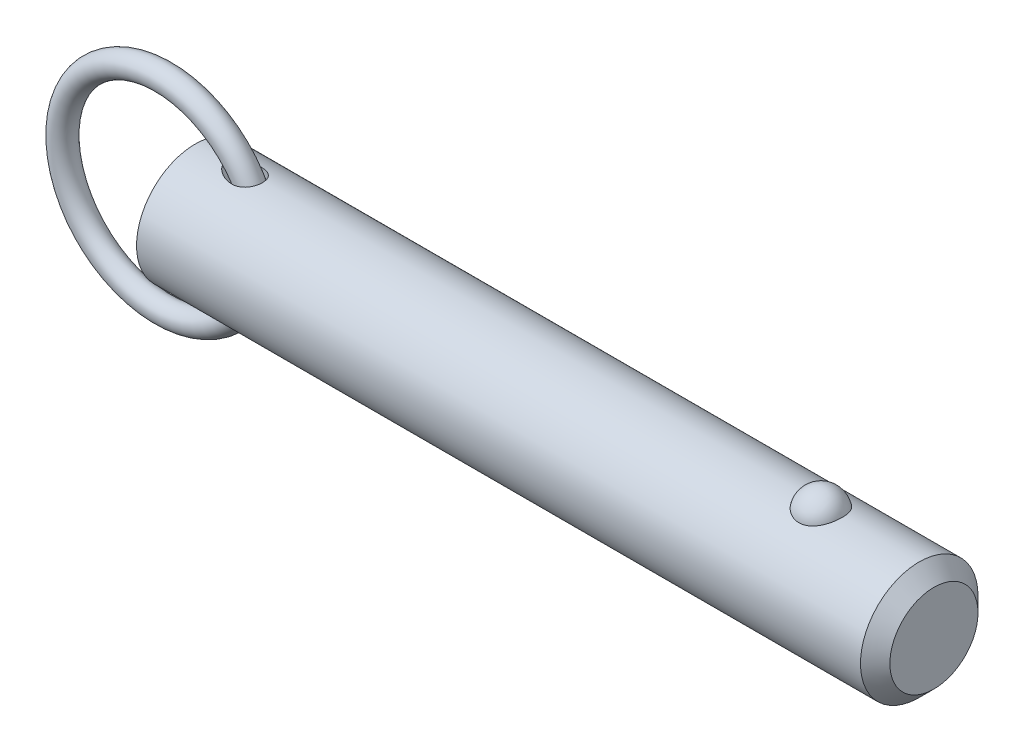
ISO-10303-21;
HEADER;
FILE_DESCRIPTION(('STEP AP214'),'2;1');
FILE_NAME('part.step','',(''),(''),'','','');
FILE_SCHEMA(('AUTOMOTIVE_DESIGN { 1 0 10303 214 1 1 1 1 }'));
ENDSEC;
DATA;
#1=APPLICATION_CONTEXT('core data for automotive mechanical design processes');
#2=APPLICATION_PROTOCOL_DEFINITION('international standard','automotive_design',2000,#1);
#3=PRODUCT_CONTEXT('',#1,'mechanical');
#4=PRODUCT('Part','Part','',(#3));
#5=PRODUCT_RELATED_PRODUCT_CATEGORY('part','',(#4));
#6=PRODUCT_DEFINITION_FORMATION('','',#4);
#7=PRODUCT_DEFINITION_CONTEXT('part definition',#1,'design');
#8=PRODUCT_DEFINITION('design','',#6,#7);
#9=PRODUCT_DEFINITION_SHAPE('','',#8);
#10=(LENGTH_UNIT() NAMED_UNIT(*) SI_UNIT(.MILLI.,.METRE.));
#11=(NAMED_UNIT(*) PLANE_ANGLE_UNIT() SI_UNIT($,.RADIAN.));
#12=(NAMED_UNIT(*) SI_UNIT($,.STERADIAN.) SOLID_ANGLE_UNIT());
#13=UNCERTAINTY_MEASURE_WITH_UNIT(LENGTH_MEASURE(1.E-05),#10,'distance_accuracy_value','');
#14=(GEOMETRIC_REPRESENTATION_CONTEXT(3) GLOBAL_UNCERTAINTY_ASSIGNED_CONTEXT((#13)) GLOBAL_UNIT_ASSIGNED_CONTEXT((#10,
#11,#12)) REPRESENTATION_CONTEXT('',''));
#15=CARTESIAN_POINT('',(0.,0.,0.));
#16=DIRECTION('',(0.,0.,1.));
#17=DIRECTION('',(1.,0.,0.));
#18=AXIS2_PLACEMENT_3D('',#15,#16,#17);
#19=CARTESIAN_POINT('',(-6.08699288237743,0.,0.));
#20=DIRECTION('',(0.,0.,1.));
#21=DIRECTION('',(1.,0.,0.));
#22=AXIS2_PLACEMENT_3D('',#19,#20,#21);
#23=TOROIDAL_SURFACE('',#22,19.05,2.223);
#24=CARTESIAN_POINT('',(15.1860071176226,0.,0.));
#25=VERTEX_POINT('',#24);
#26=VERTEX_LOOP('',#25);
#27=FACE_BOUND('',#26,.T.);
#28=ADVANCED_FACE('P0_F12',(#27),#23,.T.);
#29=CLOSED_SHELL('',(#28));
#30=MANIFOLD_SOLID_BREP('P0_B1',#29);
#31=CARTESIAN_POINT('',(0.,0.,0.));
#32=DIRECTION('',(1.,0.,0.));
#33=DIRECTION('',(0.,0.,-1.));
#34=AXIS2_PLACEMENT_3D('',#31,#32,#33);
#35=CYLINDRICAL_SURFACE('',#34,11.115);
#36=CARTESIAN_POINT('',(6.414051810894,11.0227946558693,-1.42871369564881));
#37=CARTESIAN_POINT('',(6.49338916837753,11.0115377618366,-1.5155664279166));
#38=CARTESIAN_POINT('',(6.57765461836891,10.9998263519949,-1.59789397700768));
#39=CARTESIAN_POINT('',(6.75386647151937,10.9760304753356,-1.75391400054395));
#40=CARTESIAN_POINT('',(6.84582247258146,10.9639455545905,-1.82759540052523));
#41=CARTESIAN_POINT('',(7.03627827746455,10.9397989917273,-1.96698954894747));
#42=CARTESIAN_POINT('',(7.13480838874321,10.9277377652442,-2.03266078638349));
#43=CARTESIAN_POINT('',(7.33681032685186,10.9041015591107,-2.1558582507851));
#44=CARTESIAN_POINT('',(7.44028007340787,10.8925263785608,-2.21338786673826));
#45=CARTESIAN_POINT('',(7.64386117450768,10.8710104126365,-2.31666528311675));
#46=CARTESIAN_POINT('',(7.74368989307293,10.8610119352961,-2.36295942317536));
#47=CARTESIAN_POINT('',(7.94637195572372,10.8420168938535,-2.44863486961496));
#48=CARTESIAN_POINT('',(8.04922612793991,10.8330206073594,-2.48801426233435));
#49=CARTESIAN_POINT('',(8.36115573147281,10.807980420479,-2.59542730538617));
#50=CARTESIAN_POINT('',(8.57411849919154,10.7938278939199,-2.65299817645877));
#51=CARTESIAN_POINT('',(9.00825016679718,10.7725818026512,-2.73800108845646));
#52=CARTESIAN_POINT('',(9.22947335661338,10.7655491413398,-2.76517330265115));
#53=CARTESIAN_POINT('',(9.67368141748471,10.7605872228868,-2.78445308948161));
#54=CARTESIAN_POINT('',(9.89666486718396,10.7626512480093,-2.77658653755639));
#55=CARTESIAN_POINT('',(10.2950172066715,10.7754452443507,-2.72644436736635));
#56=CARTESIAN_POINT('',(10.4712789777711,10.7844280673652,-2.69109376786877));
#57=CARTESIAN_POINT('',(10.7292776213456,10.8024982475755,-2.61722365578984));
#58=CARTESIAN_POINT('',(10.8142337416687,10.8092901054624,-2.58911576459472));
#59=CARTESIAN_POINT('',(10.9813218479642,10.8242580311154,-2.52581287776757));
#60=CARTESIAN_POINT('',(11.0634550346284,10.8324335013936,-2.49062094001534));
#61=CARTESIAN_POINT('',(11.2247418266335,10.8500287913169,-2.41281958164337));
#62=CARTESIAN_POINT('',(11.3038694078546,10.8594572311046,-2.37015806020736));
#63=CARTESIAN_POINT('',(11.4576781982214,10.8792243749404,-2.27770403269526));
#64=CARTESIAN_POINT('',(11.5323615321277,10.8895626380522,-2.22791497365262));
#65=CARTESIAN_POINT('',(11.6765388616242,10.9108113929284,-2.12140590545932));
#66=CARTESIAN_POINT('',(11.7460329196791,10.9217218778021,-2.064685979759));
#67=CARTESIAN_POINT('',(11.8790597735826,10.9437207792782,-1.94471764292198));
#68=CARTESIAN_POINT('',(11.9425932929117,10.9548091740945,-1.88147002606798));
#69=CARTESIAN_POINT('',(12.109388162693,10.9851999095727,-1.69784918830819));
#70=CARTESIAN_POINT('',(12.205655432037,11.0042655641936,-1.57093023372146));
#71=CARTESIAN_POINT('',(12.374151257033,11.0393391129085,-1.3017676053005));
#72=CARTESIAN_POINT('',(12.4463875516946,11.0553479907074,-1.15952888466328));
#73=CARTESIAN_POINT('',(12.5615818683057,11.0816338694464,-0.871972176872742));
#74=CARTESIAN_POINT('',(12.6058896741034,11.0921698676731,-0.72721773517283));
#75=CARTESIAN_POINT('',(12.6699315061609,11.1075802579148,-0.432089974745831));
#76=CARTESIAN_POINT('',(12.6896681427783,11.1124552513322,-0.281717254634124));
#77=CARTESIAN_POINT('',(12.704022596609,11.1159901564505,0.0188164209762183));
#78=CARTESIAN_POINT('',(12.6988836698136,11.1147102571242,0.16896512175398));
#79=CARTESIAN_POINT('',(12.6641681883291,11.1062126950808,0.466238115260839));
#80=CARTESIAN_POINT('',(12.6345920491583,11.0989951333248,0.613362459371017));
#81=CARTESIAN_POINT('',(12.5517453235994,11.0794095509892,0.900330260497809));
#82=CARTESIAN_POINT('',(12.4984878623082,11.0670443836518,1.04017770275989));
#83=CARTESIAN_POINT('',(12.3696588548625,11.0385082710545,1.308745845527));
#84=CARTESIAN_POINT('',(12.2940887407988,11.0223375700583,1.43746725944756));
#85=CARTESIAN_POINT('',(12.122380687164,10.987872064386,1.68079704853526));
#86=CARTESIAN_POINT('',(12.0261637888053,10.969569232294,1.79534850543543));
#87=CARTESIAN_POINT('',(11.8161707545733,10.932836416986,2.00695695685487));
#88=CARTESIAN_POINT('',(11.7023941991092,10.9144064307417,2.10401353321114));
#89=CARTESIAN_POINT('',(11.4575656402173,10.8788057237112,2.28105326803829));
#90=CARTESIAN_POINT('',(11.3261451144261,10.8616794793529,2.36053412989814));
#91=CARTESIAN_POINT('',(11.0523589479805,10.8308019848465,2.49839044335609));
#92=CARTESIAN_POINT('',(10.9099908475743,10.8170514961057,2.55676113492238));
#93=CARTESIAN_POINT('',(10.6060622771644,10.7929728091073,2.65666105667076));
#94=CARTESIAN_POINT('',(10.4438877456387,10.7830209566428,2.69640163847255));
#95=CARTESIAN_POINT('',(10.1154037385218,10.7687230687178,2.75293129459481));
#96=CARTESIAN_POINT('',(9.94909141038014,10.7643810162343,2.76970406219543));
#97=CARTESIAN_POINT('',(9.54387061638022,10.7604809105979,2.7848723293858));
#98=CARTESIAN_POINT('',(9.30446860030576,10.7637793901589,2.7722775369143));
#99=CARTESIAN_POINT('',(8.94961255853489,10.7757341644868,2.72524141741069));
#100=CARTESIAN_POINT('',(8.83186896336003,10.7808994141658,2.70482239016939));
#101=CARTESIAN_POINT('',(8.59835142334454,10.7932548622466,2.6550999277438));
#102=CARTESIAN_POINT('',(8.48257728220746,10.8004448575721,2.62579738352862));
#103=CARTESIAN_POINT('',(8.25208469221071,10.8166382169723,2.55827624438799));
#104=CARTESIAN_POINT('',(8.13740214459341,10.8256649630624,2.51994155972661));
#105=CARTESIAN_POINT('',(7.91132058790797,10.8451170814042,2.43486475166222));
#106=CARTESIAN_POINT('',(7.79992154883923,10.8555424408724,2.38812270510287));
#107=CARTESIAN_POINT('',(7.58115677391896,10.8774251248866,2.28638483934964));
#108=CARTESIAN_POINT('',(7.47378802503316,10.8888816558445,2.23139534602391));
#109=CARTESIAN_POINT('',(7.26385624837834,10.9124540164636,2.1131026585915));
#110=CARTESIAN_POINT('',(7.16129168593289,10.9245696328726,2.04980214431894));
#111=CARTESIAN_POINT('',(6.91882218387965,10.9543689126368,1.88540538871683));
#112=CARTESIAN_POINT('',(6.78193778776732,10.9721958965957,1.77979827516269));
#113=CARTESIAN_POINT('',(6.52472441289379,11.0070222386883,1.54989693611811));
#114=CARTESIAN_POINT('',(6.40436902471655,11.0240228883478,1.42563320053));
#115=CARTESIAN_POINT('',(6.21838804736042,11.0509658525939,1.19529359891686));
#116=CARTESIAN_POINT('',(6.14691885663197,11.0615430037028,1.09404520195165));
#117=CARTESIAN_POINT('',(6.02043496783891,11.0805004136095,0.881508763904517));
#118=CARTESIAN_POINT('',(5.96539400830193,11.0888841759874,0.770237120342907));
#119=CARTESIAN_POINT('',(5.88475453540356,11.1012553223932,0.560577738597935));
#120=CARTESIAN_POINT('',(5.85559643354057,11.1057686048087,0.463603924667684));
#121=CARTESIAN_POINT('',(5.81381299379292,11.1122523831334,0.266083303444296));
#122=CARTESIAN_POINT('',(5.80117118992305,11.1142254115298,0.165540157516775));
#123=CARTESIAN_POINT('',(5.79363815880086,11.1153999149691,-0.0364747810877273));
#124=CARTESIAN_POINT('',(5.79878799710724,11.1145949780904,-0.137948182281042));
#125=CARTESIAN_POINT('',(5.82639592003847,11.1102987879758,-0.338493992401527));
#126=CARTESIAN_POINT('',(5.84887234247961,11.1068046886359,-0.437563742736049));
#127=CARTESIAN_POINT('',(5.91510741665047,11.0965857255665,-0.649968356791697));
#128=CARTESIAN_POINT('',(5.96220905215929,11.0893566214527,-0.762222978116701));
#129=CARTESIAN_POINT('',(6.0737844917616,11.072471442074,-0.977396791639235));
#130=CARTESIAN_POINT('',(6.13826787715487,11.0628140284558,-1.08031079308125));
#131=CARTESIAN_POINT('',(6.24101077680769,11.0477136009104,-1.2219580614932));
#132=CARTESIAN_POINT('',(6.27403486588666,11.042895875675,-1.26469183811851));
#133=CARTESIAN_POINT('',(6.34238022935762,11.0330152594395,-1.34817011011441));
#134=CARTESIAN_POINT('',(6.37769867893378,11.0279526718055,-1.38891694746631));
#135=CARTESIAN_POINT('',(6.414051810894,11.0227946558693,-1.42871369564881));
#136=B_SPLINE_CURVE_WITH_KNOTS('',3,(#36,#37,#38,#39,#40,#41,#42,#43,#44,#45,#46,#47,#48,#49,
#50,#51,#52,#53,#54,#55,#56,#57,#58,#59,#60,#61,#62,#63,#64,#65,#66,#67,#68,#69,#70,#71,#72,#73,
#74,#75,#76,#77,#78,#79,#80,#81,#82,#83,#84,#85,#86,#87,#88,#89,#90,#91,#92,#93,#94,#95,#96,#97,
#98,#99,#100,#101,#102,#103,#104,#105,#106,#107,#108,#109,#110,#111,#112,#113,#114,#115,#116,
#117,#118,#119,#120,#121,#122,#123,#124,#125,#126,#127,#128,#129,#130,#131,#132,#133,#134,#135),
.UNSPECIFIED.,.T.,.F.,(4,2,2,2,2,2,2,2,2,2,2,2,2,2,2,2,2,2,2,2,2,2,2,2,2,2,2,2,2,2,2,2,2,2,2,2,
2,2,2,2,2,2,2,2,2,2,2,2,2,4),(0.,0.354433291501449,0.709315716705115,1.0659654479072,
1.42246628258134,1.75367157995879,2.08496839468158,2.74582009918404,3.41227815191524,
4.07824412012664,4.61583787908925,4.88478112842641,5.15360853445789,5.42439170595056,
5.6950443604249,5.96569375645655,6.23631025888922,6.7149072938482,7.1933500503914,
7.6464143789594,8.09943057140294,8.54802575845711,8.99661331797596,9.44495256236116,
9.89326303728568,10.3433195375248,10.7933867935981,11.2550086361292,11.7167345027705,
12.2165866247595,12.7167934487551,13.4318876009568,13.7904664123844,14.1490092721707,
14.5124394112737,14.8758662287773,15.239015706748,15.6020483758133,16.1219860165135,
16.6410830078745,17.0130520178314,17.3844231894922,17.6872330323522,17.9897407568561,
18.2929471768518,18.5964749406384,18.9603532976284,19.3244326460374,19.4870338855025,
19.649438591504),.UNSPECIFIED.);
#137=CARTESIAN_POINT('',(6.414051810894,11.0227946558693,-1.42871369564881));
#138=VERTEX_POINT('',#137);
#139=EDGE_CURVE('P1_E40',#138,#138,#136,.T.);
#140=ORIENTED_EDGE('',*,*,#139,.T.);
#141=EDGE_LOOP('',(#140));
#142=FACE_BOUND('',#141,.T.);
#143=CARTESIAN_POINT('',(136.92125,0.,0.));
#144=DIRECTION('',(1.,0.,0.));
#145=DIRECTION('',(0.,0.,-1.));
#146=AXIS2_PLACEMENT_3D('',#143,#144,#145);
#147=CIRCLE('',#146,11.115);
#148=CARTESIAN_POINT('',(136.92125,0.,-11.115));
#149=VERTEX_POINT('',#148);
#150=EDGE_CURVE('P1_E25',#149,#149,#147,.T.);
#151=ORIENTED_EDGE('',*,*,#150,.F.);
#152=EDGE_LOOP('',(#151));
#153=FACE_BOUND('',#152,.T.);
#154=CARTESIAN_POINT('',(0.,0.,0.));
#155=DIRECTION('',(1.,0.,0.));
#156=DIRECTION('',(0.,0.,-1.));
#157=AXIS2_PLACEMENT_3D('',#154,#155,#156);
#158=CIRCLE('',#157,11.115);
#159=CARTESIAN_POINT('',(0.,0.,-11.115));
#160=VERTEX_POINT('',#159);
#161=EDGE_CURVE('P1_E9',#160,#160,#158,.T.);
#162=ORIENTED_EDGE('',*,*,#161,.T.);
#163=EDGE_LOOP('',(#162));
#164=FACE_BOUND('',#163,.T.);
#165=CARTESIAN_POINT('',(118.331068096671,10.3028087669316,4.17077409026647));
#166=CARTESIAN_POINT('',(118.114775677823,10.3028003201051,4.17078240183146));
#167=CARTESIAN_POINT('',(117.898548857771,10.3098895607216,4.15340593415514));
#168=CARTESIAN_POINT('',(117.472540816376,10.3373834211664,4.08449540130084));
#169=CARTESIAN_POINT('',(117.262757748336,10.3577841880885,4.03297121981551));
#170=CARTESIAN_POINT('',(116.855782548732,10.4095237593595,3.89746513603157));
#171=CARTESIAN_POINT('',(116.658572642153,10.4408466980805,3.81353029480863));
#172=CARTESIAN_POINT('',(116.281338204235,10.5110236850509,3.61560339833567));
#173=CARTESIAN_POINT('',(116.101317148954,10.5498792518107,3.50160528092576));
#174=CARTESIAN_POINT('',(115.757684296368,10.6322884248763,3.24292464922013));
#175=CARTESIAN_POINT('',(115.594686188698,10.6759443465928,3.09746040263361));
#176=CARTESIAN_POINT('',(115.294591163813,10.7625291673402,2.78171925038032));
#177=CARTESIAN_POINT('',(115.157499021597,10.8054579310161,2.61143778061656));
#178=CARTESIAN_POINT('',(114.906408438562,10.8881935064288,2.24226695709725));
#179=CARTESIAN_POINT('',(114.793710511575,10.9277761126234,2.04244123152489));
#180=CARTESIAN_POINT('',(114.601777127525,10.997484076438,1.62578254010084));
#181=CARTESIAN_POINT('',(114.522544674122,11.0276085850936,1.40894804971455));
#182=CARTESIAN_POINT('',(114.398303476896,11.0756732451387,0.961250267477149));
#183=CARTESIAN_POINT('',(114.353760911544,11.0934470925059,0.730239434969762));
#184=CARTESIAN_POINT('',(114.301569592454,11.1143331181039,0.263439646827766));
#185=CARTESIAN_POINT('',(114.293920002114,11.1174456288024,0.0276507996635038));
#186=CARTESIAN_POINT('',(114.31561056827,11.1087161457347,-0.440729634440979));
#187=CARTESIAN_POINT('',(114.344762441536,11.0969502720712,-0.673331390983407));
#188=CARTESIAN_POINT('',(114.439143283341,11.0597872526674,-1.12996621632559));
#189=CARTESIAN_POINT('',(114.504372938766,11.0343898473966,-1.35399912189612));
#190=CARTESIAN_POINT('',(114.66969844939,10.972515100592,-1.78750286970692));
#191=CARTESIAN_POINT('',(114.76983863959,10.9360236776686,-1.99695478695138));
#192=CARTESIAN_POINT('',(115.002940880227,10.8557595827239,-2.39520667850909));
#193=CARTESIAN_POINT('',(115.135905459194,10.8119863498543,-2.5840050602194));
#194=CARTESIAN_POINT('',(115.432407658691,10.7216733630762,-2.93635726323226));
#195=CARTESIAN_POINT('',(115.596056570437,10.675123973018,-3.09981510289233));
#196=CARTESIAN_POINT('',(115.949860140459,10.5846571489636,-3.39592247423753));
#197=CARTESIAN_POINT('',(116.140012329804,10.5407394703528,-3.52857487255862));
#198=CARTESIAN_POINT('',(116.53750141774,10.4616690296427,-3.75646057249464));
#199=CARTESIAN_POINT('',(116.74436705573,10.4263443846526,-3.85245432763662));
#200=CARTESIAN_POINT('',(117.172954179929,10.3675574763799,-4.00798747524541));
#201=CARTESIAN_POINT('',(117.394670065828,10.3440907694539,-4.06754052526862));
#202=CARTESIAN_POINT('',(117.834669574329,10.3128282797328,-4.14614314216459));
#203=CARTESIAN_POINT('',(118.052565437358,10.3043040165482,-4.16707833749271));
#204=CARTESIAN_POINT('',(118.48894951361,10.3016771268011,-4.17357158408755));
#205=CARTESIAN_POINT('',(118.707437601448,10.3075716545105,-4.15913661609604));
#206=CARTESIAN_POINT('',(119.131744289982,10.3326686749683,-4.09636961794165));
#207=CARTESIAN_POINT('',(119.337745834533,10.3514555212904,-4.04909574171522));
#208=CARTESIAN_POINT('',(119.738576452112,10.3998183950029,-3.92320197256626));
#209=CARTESIAN_POINT('',(119.9334046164,10.4293952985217,-3.84457953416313));
#210=CARTESIAN_POINT('',(120.311191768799,10.4969600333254,-3.65612410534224));
#211=CARTESIAN_POINT('',(120.493797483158,10.5351178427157,-3.5456454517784));
#212=CARTESIAN_POINT('',(120.838204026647,10.6154999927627,-3.29718036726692));
#213=CARTESIAN_POINT('',(121.000000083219,10.657725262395,-3.15918764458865));
#214=CARTESIAN_POINT('',(121.306959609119,10.744212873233,-2.85163580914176));
#215=CARTESIAN_POINT('',(121.450891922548,10.7884718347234,-2.68084605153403));
#216=CARTESIAN_POINT('',(121.709237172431,10.872374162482,-2.31721864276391));
#217=CARTESIAN_POINT('',(121.823644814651,10.9120167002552,-2.12437704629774));
#218=CARTESIAN_POINT('',(122.023873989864,10.9838919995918,-1.71516999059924));
#219=CARTESIAN_POINT('',(122.10866178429,11.0158465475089,-1.49824866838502));
#220=CARTESIAN_POINT('',(122.24268382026,11.0673523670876,-1.05228572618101));
#221=CARTESIAN_POINT('',(122.291917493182,11.086903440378,-0.82324391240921));
#222=CARTESIAN_POINT('',(122.353891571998,11.1116323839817,-0.359087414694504));
#223=CARTESIAN_POINT('',(122.366566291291,11.1167843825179,-0.123962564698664));
#224=CARTESIAN_POINT('',(122.354973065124,11.1121144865,0.345220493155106));
#225=CARTESIAN_POINT('',(122.330705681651,11.1022928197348,0.579278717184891));
#226=CARTESIAN_POINT('',(122.245907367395,11.0687504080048,1.03866534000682));
#227=CARTESIAN_POINT('',(122.185529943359,11.0450885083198,1.26402641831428));
#228=CARTESIAN_POINT('',(122.029853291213,10.9863185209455,1.70076772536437));
#229=CARTESIAN_POINT('',(121.934551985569,10.9512097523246,1.91214712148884));
#230=CARTESIAN_POINT('',(121.710397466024,10.8729733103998,2.316083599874));
#231=CARTESIAN_POINT('',(121.581380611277,10.8298068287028,2.50854240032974));
#232=CARTESIAN_POINT('',(121.292732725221,10.7401896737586,2.86808766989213));
#233=CARTESIAN_POINT('',(121.133102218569,10.6937390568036,3.03517457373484));
#234=CARTESIAN_POINT('',(120.787534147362,10.6029321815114,3.33857581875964));
#235=CARTESIAN_POINT('',(120.601708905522,10.5585680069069,3.47501541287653));
#236=CARTESIAN_POINT('',(120.207875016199,10.4769321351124,3.71390897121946));
#237=CARTESIAN_POINT('',(119.999863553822,10.439661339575,3.81635861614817));
#238=CARTESIAN_POINT('',(119.554066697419,10.3749407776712,3.9891063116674));
#239=CARTESIAN_POINT('',(119.315234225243,10.3482457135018,4.0570092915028));
#240=CARTESIAN_POINT('',(118.827925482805,10.312188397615,4.14782844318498));
#241=CARTESIAN_POINT('',(118.579453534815,10.3028184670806,4.17076454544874));
#242=CARTESIAN_POINT('',(118.331068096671,10.3028087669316,4.17077409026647));
#243=B_SPLINE_CURVE_WITH_KNOTS('',3,(#165,#166,#167,#168,#169,#170,#171,#172,#173,#174,#175,
#176,#177,#178,#179,#180,#181,#182,#183,#184,#185,#186,#187,#188,#189,#190,#191,#192,#193,#194,
#195,#196,#197,#198,#199,#200,#201,#202,#203,#204,#205,#206,#207,#208,#209,#210,#211,#212,#213,
#214,#215,#216,#217,#218,#219,#220,#221,#222,#223,#224,#225,#226,#227,#228,#229,#230,#231,#232,
#233,#234,#235,#236,#237,#238,#239,#240,#241,#242),.UNSPECIFIED.,.T.,.F.,(4,2,2,2,2,2,2,2,2,2,2,
2,2,2,2,2,2,2,2,2,2,2,2,2,2,2,2,2,2,2,2,2,2,2,2,2,2,2,4),(0.,0.647966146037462,1.29574482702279,
1.94258643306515,2.58955857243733,3.25496465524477,3.92049326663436,4.61566368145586,
5.31089647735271,6.0153182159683,6.71972398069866,7.42054043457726,8.12137023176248,
8.82309331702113,9.52487047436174,10.2292439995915,10.9335519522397,11.622333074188,
12.3108558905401,12.9647664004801,13.6185478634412,14.2521847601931,14.8858731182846,
15.5334360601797,16.1811472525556,16.8611459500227,17.5412664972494,18.2431855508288,
18.9451158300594,19.6483065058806,20.3514864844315,21.0516982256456,21.7519516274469,
22.4556690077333,23.1593743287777,23.8601491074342,24.5610129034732,25.3054529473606,
26.0495629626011),.UNSPECIFIED.);
#244=CARTESIAN_POINT('',(118.331068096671,10.3028087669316,4.17077409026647));
#245=VERTEX_POINT('',#244);
#246=EDGE_CURVE('P1_E34',#245,#245,#243,.T.);
#247=ORIENTED_EDGE('',*,*,#246,.T.);
#248=EDGE_LOOP('',(#247));
#249=FACE_BOUND('',#248,.T.);
#250=CARTESIAN_POINT('',(6.414051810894,-11.0227946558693,-1.42871369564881));
#251=CARTESIAN_POINT('',(6.3312406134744,-11.0345445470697,-1.33806125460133));
#252=CARTESIAN_POINT('',(6.25372866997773,-11.0458090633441,-1.24240732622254));
#253=CARTESIAN_POINT('',(6.11277905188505,-11.0666115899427,-1.04095704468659));
#254=CARTESIAN_POINT('',(6.04933920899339,-11.0761498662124,-0.935162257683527));
#255=CARTESIAN_POINT('',(5.94029181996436,-11.0927063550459,-0.712476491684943));
#256=CARTESIAN_POINT('',(5.89492964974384,-11.0996897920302,-0.595457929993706));
#257=CARTESIAN_POINT('',(5.8449816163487,-11.1074141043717,-0.414997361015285));
#258=CARTESIAN_POINT('',(5.83135004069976,-11.1095300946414,-0.354047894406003));
#259=CARTESIAN_POINT('',(5.81051649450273,-11.1127688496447,-0.23104152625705));
#260=CARTESIAN_POINT('',(5.80331311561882,-11.1138918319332,-0.168984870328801));
#261=CARTESIAN_POINT('',(5.7929652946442,-11.1155042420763,-0.000484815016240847));
#262=CARTESIAN_POINT('',(5.79625267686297,-11.1149904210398,0.106437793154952));
#263=CARTESIAN_POINT('',(5.82213676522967,-11.1109609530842,0.317809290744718));
#264=CARTESIAN_POINT('',(5.84474662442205,-11.1074432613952,0.422256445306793));
#265=CARTESIAN_POINT('',(5.91113114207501,-11.097197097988,0.639361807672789));
#266=CARTESIAN_POINT('',(5.95733120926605,-11.090102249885,0.751250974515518));
#267=CARTESIAN_POINT('',(6.06709542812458,-11.0734770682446,0.965912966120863));
#268=CARTESIAN_POINT('',(6.13068735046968,-11.06394284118,1.06867085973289));
#269=CARTESIAN_POINT('',(6.30294237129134,-11.0385920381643,1.30890635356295));
#270=CARTESIAN_POINT('',(6.41896200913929,-11.0218881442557,1.44097376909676));
#271=CARTESIAN_POINT('',(6.66989654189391,-10.9871512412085,1.68553954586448));
#272=CARTESIAN_POINT('',(6.80485520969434,-10.9691152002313,1.79799117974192));
#273=CARTESIAN_POINT('',(7.04881236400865,-10.9382283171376,1.97587596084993));
#274=CARTESIAN_POINT('',(7.15465712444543,-10.9253240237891,2.04570822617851));
#275=CARTESIAN_POINT('',(7.37202504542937,-10.9000987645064,2.17611840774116));
#276=CARTESIAN_POINT('',(7.48355057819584,-10.8877780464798,2.23669241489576));
#277=CARTESIAN_POINT('',(7.71132418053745,-10.8641580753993,2.34873831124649));
#278=CARTESIAN_POINT('',(7.82757727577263,-10.8528599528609,2.40020018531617));
#279=CARTESIAN_POINT('',(8.06386825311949,-10.8317234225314,2.49385169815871));
#280=CARTESIAN_POINT('',(8.18390558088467,-10.8218848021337,2.53604268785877));
#281=CARTESIAN_POINT('',(8.42918336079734,-10.8039208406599,2.61152283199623));
#282=CARTESIAN_POINT('',(8.55447802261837,-10.7958283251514,2.64464414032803));
#283=CARTESIAN_POINT('',(8.8075212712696,-10.781995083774,2.70048793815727));
#284=CARTESIAN_POINT('',(8.93527019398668,-10.7762546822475,2.72320899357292));
#285=CARTESIAN_POINT('',(9.19210176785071,-10.7675291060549,2.75750994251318));
#286=CARTESIAN_POINT('',(9.32118105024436,-10.7645381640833,2.76911315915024));
#287=CARTESIAN_POINT('',(9.57984338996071,-10.761622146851,2.78042035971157));
#288=CARTESIAN_POINT('',(9.70942621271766,-10.7616957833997,2.78012934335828));
#289=CARTESIAN_POINT('',(10.0243125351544,-10.7659059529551,2.76381534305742));
#290=CARTESIAN_POINT('',(10.209307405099,-10.7717977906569,2.74099674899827));
#291=CARTESIAN_POINT('',(10.5731188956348,-10.7905408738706,2.66626238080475));
#292=CARTESIAN_POINT('',(10.7519389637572,-10.8033881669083,2.61436313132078));
#293=CARTESIAN_POINT('',(11.0114289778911,-10.8271584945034,2.51336808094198));
#294=CARTESIAN_POINT('',(11.096831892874,-10.835881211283,2.47562331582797));
#295=CARTESIAN_POINT('',(11.2636000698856,-10.8545688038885,2.39236170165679));
#296=CARTESIAN_POINT('',(11.3449673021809,-10.8645330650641,2.3468486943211));
#297=CARTESIAN_POINT('',(11.5027832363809,-10.8853818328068,2.24815967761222));
#298=CARTESIAN_POINT('',(11.5792327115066,-10.8962661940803,2.19498487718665));
#299=CARTESIAN_POINT('',(11.7263315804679,-10.9185541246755,2.08128855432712));
#300=CARTESIAN_POINT('',(11.7969818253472,-10.9299576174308,2.02076811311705));
#301=CARTESIAN_POINT('',(11.9817953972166,-10.9613645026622,1.84513663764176));
#302=CARTESIAN_POINT('',(12.0893012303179,-10.9814643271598,1.72286660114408));
#303=CARTESIAN_POINT('',(12.2803576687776,-11.0193991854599,1.46066991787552));
#304=CARTESIAN_POINT('',(12.3639173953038,-11.0372350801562,1.3207500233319));
#305=CARTESIAN_POINT('',(12.4996220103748,-11.0672969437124,1.03778067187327));
#306=CARTESIAN_POINT('',(12.5535315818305,-11.0798242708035,0.895607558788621));
#307=CARTESIAN_POINT('',(12.636874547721,-11.0995427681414,0.603918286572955));
#308=CARTESIAN_POINT('',(12.6663115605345,-11.1067347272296,0.454403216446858));
#309=CARTESIAN_POINT('',(12.6997387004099,-11.1149224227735,0.154577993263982));
#310=CARTESIAN_POINT('',(12.7040886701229,-11.1160057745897,0.00431019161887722));
#311=CARTESIAN_POINT('',(12.6882048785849,-11.1120956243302,-0.29484108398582));
#312=CARTESIAN_POINT('',(12.6679715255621,-11.1071022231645,-0.443724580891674));
#313=CARTESIAN_POINT('',(12.6034470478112,-11.0915888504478,-0.735688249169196));
#314=CARTESIAN_POINT('',(12.5591858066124,-11.0810757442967,-0.878775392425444));
#315=CARTESIAN_POINT('',(12.4477416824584,-11.0556687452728,-1.15529525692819));
#316=CARTESIAN_POINT('',(12.3805601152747,-11.0407751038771,-1.2887285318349));
#317=CARTESIAN_POINT('',(12.2248919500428,-11.0081839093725,-1.54257976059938));
#318=CARTESIAN_POINT('',(12.1363549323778,-10.9904797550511,-1.66296592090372));
#319=CARTESIAN_POINT('',(11.9406137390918,-10.9541951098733,-1.88726577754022));
#320=CARTESIAN_POINT('',(11.833409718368,-10.9356146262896,-1.99117961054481));
#321=CARTESIAN_POINT('',(11.601318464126,-10.8991360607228,-2.18213646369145));
#322=CARTESIAN_POINT('',(11.4761325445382,-10.8812577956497,-2.26881927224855));
#323=CARTESIAN_POINT('',(11.2134852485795,-10.8482871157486,-2.42157282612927));
#324=CARTESIAN_POINT('',(11.0760218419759,-10.8331951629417,-2.48764015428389));
#325=CARTESIAN_POINT('',(10.7828968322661,-10.8061050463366,-2.60290068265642));
#326=CARTESIAN_POINT('',(10.6266338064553,-10.7943907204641,-2.65062248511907));
#327=CARTESIAN_POINT('',(10.3086617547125,-10.7762429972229,-2.72345054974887));
#328=CARTESIAN_POINT('',(10.146948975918,-10.7698133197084,-2.74854088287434));
#329=CARTESIAN_POINT('',(9.75541304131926,-10.7608036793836,-2.78368719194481));
#330=CARTESIAN_POINT('',(9.52459435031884,-10.7608467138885,-2.78350276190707));
#331=CARTESIAN_POINT('',(9.06604960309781,-10.7702674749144,-2.74677945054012));
#332=CARTESIAN_POINT('',(8.83832966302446,-10.7796615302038,-2.71017697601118));
#333=CARTESIAN_POINT('',(8.38783466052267,-10.8058248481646,-2.60392490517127));
#334=CARTESIAN_POINT('',(8.1651710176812,-10.8226939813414,-2.53382676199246));
#335=CARTESIAN_POINT('',(7.84087311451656,-10.8516548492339,-2.40555545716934));
#336=CARTESIAN_POINT('',(7.73435551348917,-10.8619221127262,-2.35892455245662));
#337=CARTESIAN_POINT('',(7.52510420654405,-10.883357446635,-2.25797017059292));
#338=CARTESIAN_POINT('',(7.4223698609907,-10.8945253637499,-2.20364800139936));
#339=CARTESIAN_POINT('',(7.23808758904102,-10.915528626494,-2.09688018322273));
#340=CARTESIAN_POINT('',(7.15584631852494,-10.9252787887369,-2.0456107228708));
#341=CARTESIAN_POINT('',(6.99510576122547,-10.944960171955,-1.93754729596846));
#342=CARTESIAN_POINT('',(6.91660574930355,-10.9548913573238,-1.88075440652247));
#343=CARTESIAN_POINT('',(6.76418133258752,-10.974690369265,-1.76154504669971));
#344=CARTESIAN_POINT('',(6.69024940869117,-10.9845582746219,-1.6991382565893));
#345=CARTESIAN_POINT('',(6.54780119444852,-11.0039826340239,-1.56842485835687));
#346=CARTESIAN_POINT('',(6.47928247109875,-11.0135392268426,-1.50012092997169));
#347=CARTESIAN_POINT('',(6.414051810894,-11.0227946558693,-1.42871369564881));
#348=B_SPLINE_CURVE_WITH_KNOTS('',3,(#250,#251,#252,#253,#254,#255,#256,#257,#258,#259,#260,
#261,#262,#263,#264,#265,#266,#267,#268,#269,#270,#271,#272,#273,#274,#275,#276,#277,#278,#279,
#280,#281,#282,#283,#284,#285,#286,#287,#288,#289,#290,#291,#292,#293,#294,#295,#296,#297,#298,
#299,#300,#301,#302,#303,#304,#305,#306,#307,#308,#309,#310,#311,#312,#313,#314,#315,#316,#317,
#318,#319,#320,#321,#322,#323,#324,#325,#326,#327,#328,#329,#330,#331,#332,#333,#334,#335,#336,
#337,#338,#339,#340,#341,#342,#343,#344,#345,#346,#347),.UNSPECIFIED.,.T.,.F.,(4,2,2,2,2,2,2,2,
2,2,2,2,2,2,2,2,2,2,2,2,2,2,2,2,2,2,2,2,2,2,2,2,2,2,2,2,2,2,2,2,2,2,2,2,2,2,2,2,4),(0.,
0.369835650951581,0.739614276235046,1.1142538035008,1.30141910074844,1.48854338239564,
1.8074587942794,2.12659146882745,2.4883888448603,2.85076733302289,3.3776216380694,
3.90571433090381,4.287639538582,4.66972556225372,5.05222896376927,5.43467659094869,
5.82378546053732,6.21294796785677,6.60129228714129,6.9894733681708,7.54669558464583,
8.10360148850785,8.38458539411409,8.66543074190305,8.94623182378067,9.22699162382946,
9.7162888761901,10.2053995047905,10.6608871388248,11.1163074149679,11.5651786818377,
12.0140424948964,12.4623493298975,12.9106304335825,13.3599804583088,13.8093267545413,
14.2672570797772,14.7252632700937,15.214740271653,15.7045615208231,16.3932594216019,
17.083162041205,17.7825738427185,18.1325177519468,18.4824022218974,18.7744056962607,
19.0663523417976,19.3578048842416,19.6491256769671),.UNSPECIFIED.);
#349=CARTESIAN_POINT('',(6.414051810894,-11.0227946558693,-1.42871369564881));
#350=VERTEX_POINT('',#349);
#351=EDGE_CURVE('P1_E17',#350,#350,#348,.T.);
#352=ORIENTED_EDGE('',*,*,#351,.T.);
#353=EDGE_LOOP('',(#352));
#354=FACE_BOUND('',#353,.T.);
#355=ADVANCED_FACE('P1_F13',(#142,#153,#164,#249,#354),#35,.T.);
#356=CARTESIAN_POINT('',(0.,0.,0.));
#357=DIRECTION('',(-1.,0.,0.));
#358=DIRECTION('',(0.,0.,1.));
#359=AXIS2_PLACEMENT_3D('',#356,#357,#358);
#360=PLANE('',#359);
#361=ORIENTED_EDGE('',*,*,#161,.F.);
#362=EDGE_LOOP('',(#361));
#363=FACE_BOUND('',#362,.T.);
#364=ADVANCED_FACE('P1_F15',(#363),#360,.T.);
#365=CARTESIAN_POINT('',(139.7,0.,0.));
#366=DIRECTION('',(-1.,0.,0.));
#367=DIRECTION('',(0.,0.,1.));
#368=AXIS2_PLACEMENT_3D('',#365,#366,#367);
#369=CONICAL_SURFACE('',#368,8.33625000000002,0.785398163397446);
#370=ORIENTED_EDGE('',*,*,#150,.T.);
#371=EDGE_LOOP('',(#370));
#372=FACE_BOUND('',#371,.T.);
#373=CARTESIAN_POINT('',(139.7,0.,0.));
#374=DIRECTION('',(1.,0.,0.));
#375=DIRECTION('',(0.,0.,-1.));
#376=AXIS2_PLACEMENT_3D('',#373,#374,#375);
#377=CIRCLE('',#376,8.33625000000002);
#378=CARTESIAN_POINT('',(139.7,0.,-8.33625000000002));
#379=VERTEX_POINT('',#378);
#380=EDGE_CURVE('P1_E30',#379,#379,#377,.T.);
#381=ORIENTED_EDGE('',*,*,#380,.F.);
#382=EDGE_LOOP('',(#381));
#383=FACE_BOUND('',#382,.T.);
#384=ADVANCED_FACE('P1_F55',(#372,#383),#369,.T.);
#385=CARTESIAN_POINT('',(139.7,8.33625000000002,0.));
#386=DIRECTION('',(1.,0.,0.));
#387=DIRECTION('',(0.,0.,-1.));
#388=AXIS2_PLACEMENT_3D('',#385,#386,#387);
#389=PLANE('',#388);
#390=ORIENTED_EDGE('',*,*,#380,.T.);
#391=EDGE_LOOP('',(#390));
#392=FACE_BOUND('',#391,.T.);
#393=ADVANCED_FACE('P1_F51',(#392),#389,.T.);
#394=CARTESIAN_POINT('',(118.331068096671,10.0035,0.));
#395=DIRECTION('',(-1.,0.,0.));
#396=DIRECTION('',(0.,1.,0.));
#397=AXIS2_PLACEMENT_3D('',#394,#395,#396);
#398=SPHERICAL_SURFACE('',#397,4.18150000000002);
#399=ORIENTED_EDGE('',*,*,#246,.F.);
#400=EDGE_LOOP('',(#399));
#401=FACE_BOUND('',#400,.T.);
#402=ADVANCED_FACE('P1_F46',(#401),#398,.T.);
#403=CARTESIAN_POINT('',(-6.08699288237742,0.,0.));
#404=DIRECTION('',(0.,0.,1.));
#405=DIRECTION('',(1.,0.,0.));
#406=AXIS2_PLACEMENT_3D('',#403,#404,#405);
#407=TOROIDAL_SURFACE('',#406,19.05,2.77875);
#408=ORIENTED_EDGE('',*,*,#351,.F.);
#409=EDGE_LOOP('',(#408));
#410=FACE_BOUND('',#409,.T.);
#411=ORIENTED_EDGE('',*,*,#139,.F.);
#412=EDGE_LOOP('',(#411));
#413=FACE_BOUND('',#412,.T.);
#414=ADVANCED_FACE('P1_F50',(#410,#413),#407,.F.);
#415=CLOSED_SHELL('',(#355,#364,#384,#393,#402,#414));
#416=MANIFOLD_SOLID_BREP('P1_B1',#415);
#417=ADVANCED_BREP_SHAPE_REPRESENTATION('',(#18,#30,#416),#14);
#418=SHAPE_DEFINITION_REPRESENTATION(#9,#417);
ENDSEC;
END-ISO-10303-21;
